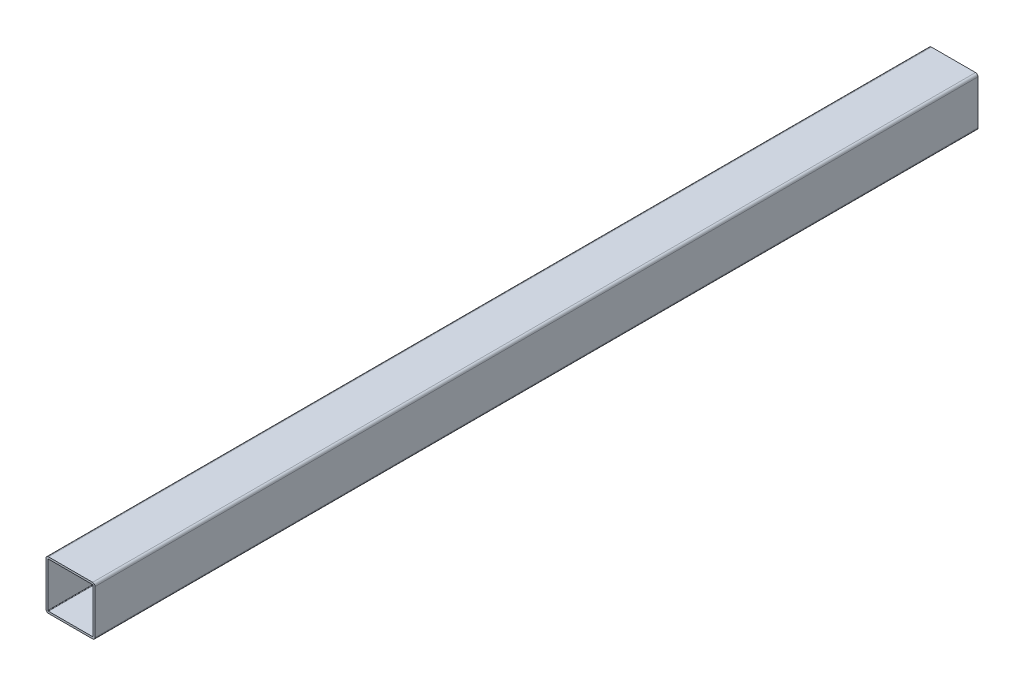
from build123d import *

# Parameters (mm, degrees)
BASE_EXTRUSION_DEPTH = 1800


with BuildPart() as part:
    # Esquisse1 → Base-Extrusion (new body)
    with BuildSketch(Plane.XY):
        with BuildLine():
            Line((5, 0), (95, 0))
            ThreePointArc((95, 0), (98.535533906, -1.464466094), (100, -5))
            Line((100, -5), (100, -95))
            ThreePointArc((100, -95), (98.535533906, -98.535533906), (95, -100))
            Line((95, -100), (5, -100))
            ThreePointArc((5, -100), (1.464466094, -98.535533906), (0, -95))
            Line((0, -95), (0, -5))
            ThreePointArc((0, -5), (1.464466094, -1.464466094), (5, 0))
        make_face()
        with BuildLine():
            Line((5, -4), (95, -4))
            ThreePointArc((95, -4), (95.707106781, -4.292893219), (96, -5))
            Line((96, -5), (96, -95))
            ThreePointArc((96, -95), (95.707106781, -95.707106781), (95, -96))
            Line((95, -96), (5, -96))
            ThreePointArc((5, -96), (4.292893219, -95.707106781), (4, -95))
            Line((4, -95), (4, -5))
            ThreePointArc((4, -5), (4.292893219, -4.292893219), (5, -4))
        make_face(mode=Mode.SUBTRACT)
    extrude(amount=BASE_EXTRUSION_DEPTH)


solid = part.part
